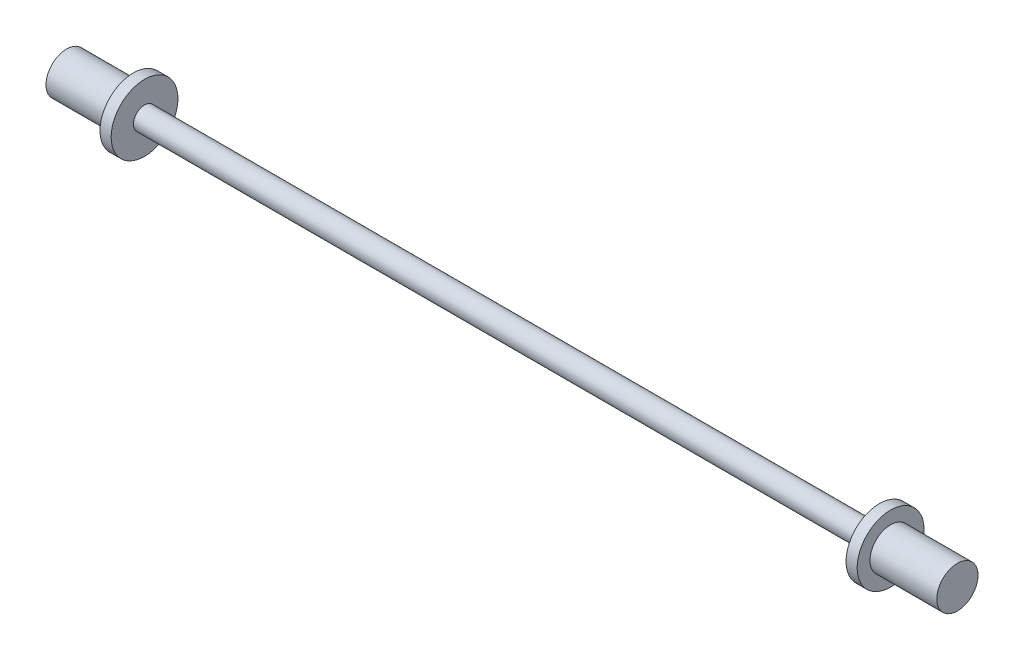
ISO-10303-21;
HEADER;
FILE_DESCRIPTION(('STEP AP214'),'2;1');
FILE_NAME('part.step','',(''),(''),'','','');
FILE_SCHEMA(('AUTOMOTIVE_DESIGN { 1 0 10303 214 1 1 1 1 }'));
ENDSEC;
DATA;
#1=APPLICATION_CONTEXT('core data for automotive mechanical design processes');
#2=APPLICATION_PROTOCOL_DEFINITION('international standard','automotive_design',2000,#1);
#3=PRODUCT_CONTEXT('',#1,'mechanical');
#4=PRODUCT('Part','Part','',(#3));
#5=PRODUCT_RELATED_PRODUCT_CATEGORY('part','',(#4));
#6=PRODUCT_DEFINITION_FORMATION('','',#4);
#7=PRODUCT_DEFINITION_CONTEXT('part definition',#1,'design');
#8=PRODUCT_DEFINITION('design','',#6,#7);
#9=PRODUCT_DEFINITION_SHAPE('','',#8);
#10=(LENGTH_UNIT() NAMED_UNIT(*) SI_UNIT(.MILLI.,.METRE.));
#11=(NAMED_UNIT(*) PLANE_ANGLE_UNIT() SI_UNIT($,.RADIAN.));
#12=(NAMED_UNIT(*) SI_UNIT($,.STERADIAN.) SOLID_ANGLE_UNIT());
#13=UNCERTAINTY_MEASURE_WITH_UNIT(LENGTH_MEASURE(1.E-05),#10,'distance_accuracy_value','');
#14=(GEOMETRIC_REPRESENTATION_CONTEXT(3) GLOBAL_UNCERTAINTY_ASSIGNED_CONTEXT((#13)) GLOBAL_UNIT_ASSIGNED_CONTEXT((#10,
#11,#12)) REPRESENTATION_CONTEXT('',''));
#15=CARTESIAN_POINT('',(0.,0.,0.));
#16=DIRECTION('',(0.,0.,1.));
#17=DIRECTION('',(1.,0.,0.));
#18=AXIS2_PLACEMENT_3D('',#15,#16,#17);
#19=CARTESIAN_POINT('',(-171.45,0.,0.));
#20=DIRECTION('',(1.,0.,0.));
#21=DIRECTION('',(0.,0.,-1.));
#22=AXIS2_PLACEMENT_3D('',#19,#20,#21);
#23=CYLINDRICAL_SURFACE('',#22,6.35);
#24=CARTESIAN_POINT('',(-171.45,0.,0.));
#25=DIRECTION('',(1.,0.,0.));
#26=DIRECTION('',(0.,0.,-1.));
#27=AXIS2_PLACEMENT_3D('',#24,#25,#26);
#28=CIRCLE('',#27,6.35);
#29=CARTESIAN_POINT('',(-171.45,0.,-6.35));
#30=VERTEX_POINT('',#29);
#31=EDGE_CURVE('E42',#30,#30,#28,.T.);
#32=ORIENTED_EDGE('',*,*,#31,.T.);
#33=EDGE_LOOP('',(#32));
#34=FACE_BOUND('',#33,.T.);
#35=CARTESIAN_POINT('',(247.65,0.,0.));
#36=DIRECTION('',(1.,0.,0.));
#37=DIRECTION('',(0.,0.,-1.));
#38=AXIS2_PLACEMENT_3D('',#35,#36,#37);
#39=CIRCLE('',#38,6.35);
#40=CARTESIAN_POINT('',(247.65,0.,-6.35));
#41=VERTEX_POINT('',#40);
#42=EDGE_CURVE('E51',#41,#41,#39,.T.);
#43=ORIENTED_EDGE('',*,*,#42,.F.);
#44=EDGE_LOOP('',(#43));
#45=FACE_BOUND('',#44,.T.);
#46=ADVANCED_FACE('F39',(#34,#45),#23,.T.);
#47=CARTESIAN_POINT('',(254.,0.,0.));
#48=DIRECTION('',(-1.,0.,0.));
#49=DIRECTION('',(0.,0.,1.));
#50=AXIS2_PLACEMENT_3D('',#47,#48,#49);
#51=CYLINDRICAL_SURFACE('',#50,19.05);
#52=CARTESIAN_POINT('',(254.,0.,0.));
#53=DIRECTION('',(1.,0.,0.));
#54=DIRECTION('',(0.,0.,-1.));
#55=AXIS2_PLACEMENT_3D('',#52,#53,#54);
#56=CIRCLE('',#55,19.05);
#57=CARTESIAN_POINT('',(254.,0.,-19.05));
#58=VERTEX_POINT('',#57);
#59=EDGE_CURVE('E65',#58,#58,#56,.T.);
#60=ORIENTED_EDGE('',*,*,#59,.F.);
#61=EDGE_LOOP('',(#60));
#62=FACE_BOUND('',#61,.T.);
#63=CARTESIAN_POINT('',(247.65,0.,0.));
#64=DIRECTION('',(1.,0.,0.));
#65=DIRECTION('',(0.,0.,-1.));
#66=AXIS2_PLACEMENT_3D('',#63,#64,#65);
#67=CIRCLE('',#66,19.05);
#68=CARTESIAN_POINT('',(247.65,0.,-19.05));
#69=VERTEX_POINT('',#68);
#70=EDGE_CURVE('E68',#69,#69,#67,.T.);
#71=ORIENTED_EDGE('',*,*,#70,.T.);
#72=EDGE_LOOP('',(#71));
#73=FACE_BOUND('',#72,.T.);
#74=ADVANCED_FACE('F77',(#62,#73),#51,.T.);
#75=CARTESIAN_POINT('',(254.,0.,0.));
#76=DIRECTION('',(1.,0.,0.));
#77=DIRECTION('',(0.,0.,-1.));
#78=AXIS2_PLACEMENT_3D('',#75,#76,#77);
#79=PLANE('',#78);
#80=CARTESIAN_POINT('',(254.,0.,0.));
#81=DIRECTION('',(1.,0.,0.));
#82=DIRECTION('',(0.,0.,-1.));
#83=AXIS2_PLACEMENT_3D('',#80,#81,#82);
#84=CIRCLE('',#83,11.77);
#85=CARTESIAN_POINT('',(254.,0.,11.77));
#86=VERTEX_POINT('',#85);
#87=EDGE_CURVE('E10',#86,#86,#84,.T.);
#88=ORIENTED_EDGE('',*,*,#87,.F.);
#89=EDGE_LOOP('',(#88));
#90=FACE_BOUND('',#89,.T.);
#91=ORIENTED_EDGE('',*,*,#59,.T.);
#92=EDGE_LOOP('',(#91));
#93=FACE_BOUND('',#92,.T.);
#94=ADVANCED_FACE('F82',(#90,#93),#79,.T.);
#95=CARTESIAN_POINT('',(247.65,0.,0.));
#96=DIRECTION('',(1.,0.,0.));
#97=DIRECTION('',(0.,0.,-1.));
#98=AXIS2_PLACEMENT_3D('',#95,#96,#97);
#99=PLANE('',#98);
#100=ORIENTED_EDGE('',*,*,#42,.T.);
#101=EDGE_LOOP('',(#100));
#102=FACE_BOUND('',#101,.T.);
#103=ORIENTED_EDGE('',*,*,#70,.F.);
#104=EDGE_LOOP('',(#103));
#105=FACE_BOUND('',#104,.T.);
#106=ADVANCED_FACE('F73',(#102,#105),#99,.F.);
#107=CARTESIAN_POINT('',(-177.8,0.,0.));
#108=DIRECTION('',(1.,0.,0.));
#109=DIRECTION('',(0.,0.,-1.));
#110=AXIS2_PLACEMENT_3D('',#107,#108,#109);
#111=CYLINDRICAL_SURFACE('',#110,19.05);
#112=CARTESIAN_POINT('',(-177.8,0.,0.));
#113=DIRECTION('',(-1.,0.,0.));
#114=DIRECTION('',(0.,0.,1.));
#115=AXIS2_PLACEMENT_3D('',#112,#113,#114);
#116=CIRCLE('',#115,19.05);
#117=CARTESIAN_POINT('',(-177.8,0.,19.05));
#118=VERTEX_POINT('',#117);
#119=EDGE_CURVE('E60',#118,#118,#116,.T.);
#120=ORIENTED_EDGE('',*,*,#119,.F.);
#121=EDGE_LOOP('',(#120));
#122=FACE_BOUND('',#121,.T.);
#123=CARTESIAN_POINT('',(-171.45,0.,0.));
#124=DIRECTION('',(-1.,0.,0.));
#125=DIRECTION('',(0.,0.,1.));
#126=AXIS2_PLACEMENT_3D('',#123,#124,#125);
#127=CIRCLE('',#126,19.05);
#128=CARTESIAN_POINT('',(-171.45,0.,19.05));
#129=VERTEX_POINT('',#128);
#130=EDGE_CURVE('E58',#129,#129,#127,.T.);
#131=ORIENTED_EDGE('',*,*,#130,.T.);
#132=EDGE_LOOP('',(#131));
#133=FACE_BOUND('',#132,.T.);
#134=ADVANCED_FACE('F95',(#122,#133),#111,.T.);
#135=CARTESIAN_POINT('',(-177.8,0.,0.));
#136=DIRECTION('',(-1.,0.,0.));
#137=DIRECTION('',(0.,0.,1.));
#138=AXIS2_PLACEMENT_3D('',#135,#136,#137);
#139=PLANE('',#138);
#140=CARTESIAN_POINT('',(-177.8,0.,0.));
#141=DIRECTION('',(-1.,0.,0.));
#142=DIRECTION('',(0.,0.,1.));
#143=AXIS2_PLACEMENT_3D('',#140,#141,#142);
#144=CIRCLE('',#143,11.77);
#145=CARTESIAN_POINT('',(-177.8,0.,-11.77));
#146=VERTEX_POINT('',#145);
#147=EDGE_CURVE('E46',#146,#146,#144,.T.);
#148=ORIENTED_EDGE('',*,*,#147,.F.);
#149=EDGE_LOOP('',(#148));
#150=FACE_BOUND('',#149,.T.);
#151=ORIENTED_EDGE('',*,*,#119,.T.);
#152=EDGE_LOOP('',(#151));
#153=FACE_BOUND('',#152,.T.);
#154=ADVANCED_FACE('F91',(#150,#153),#139,.T.);
#155=CARTESIAN_POINT('',(-171.45,0.,0.));
#156=DIRECTION('',(-1.,0.,0.));
#157=DIRECTION('',(0.,0.,1.));
#158=AXIS2_PLACEMENT_3D('',#155,#156,#157);
#159=PLANE('',#158);
#160=ORIENTED_EDGE('',*,*,#31,.F.);
#161=EDGE_LOOP('',(#160));
#162=FACE_BOUND('',#161,.T.);
#163=ORIENTED_EDGE('',*,*,#130,.F.);
#164=EDGE_LOOP('',(#163));
#165=FACE_BOUND('',#164,.T.);
#166=ADVANCED_FACE('F87',(#162,#165),#159,.F.);
#167=CARTESIAN_POINT('',(-215.9,0.,0.));
#168=DIRECTION('',(1.,0.,0.));
#169=DIRECTION('',(0.,0.,-1.));
#170=AXIS2_PLACEMENT_3D('',#167,#168,#169);
#171=CYLINDRICAL_SURFACE('',#170,11.77);
#172=CARTESIAN_POINT('',(-215.9,0.,0.));
#173=DIRECTION('',(-1.,0.,0.));
#174=DIRECTION('',(0.,0.,1.));
#175=AXIS2_PLACEMENT_3D('',#172,#173,#174);
#176=CIRCLE('',#175,11.77);
#177=CARTESIAN_POINT('',(-215.9,0.,-11.77));
#178=VERTEX_POINT('',#177);
#179=EDGE_CURVE('E56',#178,#178,#176,.T.);
#180=CARTESIAN_POINT('',(-215.9,0.,-11.77));
#181=CARTESIAN_POINT('',(-215.503125,0.,-11.77));
#182=CARTESIAN_POINT('',(-215.10625,0.,-11.77));
#183=CARTESIAN_POINT('',(-214.3125,0.,-11.77));
#184=CARTESIAN_POINT('',(-213.915625,0.,-11.77));
#185=CARTESIAN_POINT('',(-213.121875,0.,-11.77));
#186=CARTESIAN_POINT('',(-212.725,0.,-11.77));
#187=CARTESIAN_POINT('',(-211.93125,0.,-11.77));
#188=CARTESIAN_POINT('',(-211.534375,0.,-11.77));
#189=CARTESIAN_POINT('',(-210.740625,0.,-11.77));
#190=CARTESIAN_POINT('',(-210.34375,0.,-11.77));
#191=CARTESIAN_POINT('',(-209.55,0.,-11.77));
#192=CARTESIAN_POINT('',(-209.153125,0.,-11.77));
#193=CARTESIAN_POINT('',(-208.359375,0.,-11.77));
#194=CARTESIAN_POINT('',(-207.9625,0.,-11.77));
#195=CARTESIAN_POINT('',(-207.16875,0.,-11.77));
#196=CARTESIAN_POINT('',(-206.771875,0.,-11.77));
#197=CARTESIAN_POINT('',(-205.978125,0.,-11.77));
#198=CARTESIAN_POINT('',(-205.58125,0.,-11.77));
#199=CARTESIAN_POINT('',(-204.7875,0.,-11.77));
#200=CARTESIAN_POINT('',(-204.390625,0.,-11.77));
#201=CARTESIAN_POINT('',(-203.596875,0.,-11.77));
#202=CARTESIAN_POINT('',(-203.2,0.,-11.77));
#203=CARTESIAN_POINT('',(-202.40625,0.,-11.77));
#204=CARTESIAN_POINT('',(-202.009375,0.,-11.77));
#205=CARTESIAN_POINT('',(-201.215625,0.,-11.77));
#206=CARTESIAN_POINT('',(-200.81875,0.,-11.77));
#207=CARTESIAN_POINT('',(-200.025,0.,-11.77));
#208=CARTESIAN_POINT('',(-199.628125,0.,-11.77));
#209=CARTESIAN_POINT('',(-198.834375,0.,-11.77));
#210=CARTESIAN_POINT('',(-198.4375,0.,-11.77));
#211=CARTESIAN_POINT('',(-197.64375,0.,-11.77));
#212=CARTESIAN_POINT('',(-197.246875,0.,-11.77));
#213=CARTESIAN_POINT('',(-196.453125,0.,-11.77));
#214=CARTESIAN_POINT('',(-196.05625,0.,-11.77));
#215=CARTESIAN_POINT('',(-195.2625,0.,-11.77));
#216=CARTESIAN_POINT('',(-194.865625,0.,-11.77));
#217=CARTESIAN_POINT('',(-194.071875,0.,-11.77));
#218=CARTESIAN_POINT('',(-193.675,0.,-11.77));
#219=CARTESIAN_POINT('',(-192.88125,0.,-11.77));
#220=CARTESIAN_POINT('',(-192.484375,0.,-11.77));
#221=CARTESIAN_POINT('',(-191.690625,0.,-11.77));
#222=CARTESIAN_POINT('',(-191.29375,0.,-11.77));
#223=CARTESIAN_POINT('',(-190.5,0.,-11.77));
#224=CARTESIAN_POINT('',(-190.103125,0.,-11.77));
#225=CARTESIAN_POINT('',(-189.309375,0.,-11.77));
#226=CARTESIAN_POINT('',(-188.9125,0.,-11.77));
#227=CARTESIAN_POINT('',(-188.11875,0.,-11.77));
#228=CARTESIAN_POINT('',(-187.721875,0.,-11.77));
#229=CARTESIAN_POINT('',(-186.928125,0.,-11.77));
#230=CARTESIAN_POINT('',(-186.53125,0.,-11.77));
#231=CARTESIAN_POINT('',(-185.7375,0.,-11.77));
#232=CARTESIAN_POINT('',(-185.340625,0.,-11.77));
#233=CARTESIAN_POINT('',(-184.546875,0.,-11.77));
#234=CARTESIAN_POINT('',(-184.15,0.,-11.77));
#235=CARTESIAN_POINT('',(-183.35625,0.,-11.77));
#236=CARTESIAN_POINT('',(-182.959375,0.,-11.77));
#237=CARTESIAN_POINT('',(-182.165625,0.,-11.77));
#238=CARTESIAN_POINT('',(-181.76875,0.,-11.77));
#239=CARTESIAN_POINT('',(-180.975,0.,-11.77));
#240=CARTESIAN_POINT('',(-180.578125,0.,-11.77));
#241=CARTESIAN_POINT('',(-179.784375,0.,-11.77));
#242=CARTESIAN_POINT('',(-179.3875,0.,-11.77));
#243=CARTESIAN_POINT('',(-178.59375,0.,-11.77));
#244=CARTESIAN_POINT('',(-178.196875,0.,-11.77));
#245=CARTESIAN_POINT('',(-177.8,0.,-11.77));
#246=B_SPLINE_CURVE_WITH_KNOTS('',3,(#180,#181,#182,#183,#184,#185,#186,#187,#188,#189,#190,
#191,#192,#193,#194,#195,#196,#197,#198,#199,#200,#201,#202,#203,#204,#205,#206,#207,#208,#209,
#210,#211,#212,#213,#214,#215,#216,#217,#218,#219,#220,#221,#222,#223,#224,#225,#226,#227,#228,
#229,#230,#231,#232,#233,#234,#235,#236,#237,#238,#239,#240,#241,#242,#243,#244,#245),
.UNSPECIFIED.,.F.,.F.,(4,2,2,2,2,2,2,2,2,2,2,2,2,2,2,2,2,2,2,2,2,2,2,2,2,2,2,2,2,2,2,2,4),(0.,
1.19062499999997,2.38124999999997,3.57187499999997,4.76249999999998,5.95312499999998,
7.14374999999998,8.33437499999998,9.52499999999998,10.715625,11.90625,13.096875,14.2875,
15.478125,16.66875,17.859375,19.05,20.240625,21.43125,22.621875,23.8125,25.003125,26.19375,
27.384375,28.575,29.765625,30.95625,32.146875,33.3375,34.528125,35.71875,36.909375,38.1),.UNSPECIFIED.);
#247=EDGE_CURVE('BSEAM90',#178,#146,#246,.T.);
#248=ORIENTED_EDGE('',*,*,#179,.F.);
#249=ORIENTED_EDGE('',*,*,#147,.T.);
#250=ORIENTED_EDGE('',*,*,#247,.T.);
#251=ORIENTED_EDGE('',*,*,#247,.F.);
#252=EDGE_LOOP('',(#248,#250,#249,#251));
#253=FACE_BOUND('',#252,.T.);
#254=ADVANCED_FACE('F90',(#253),#171,.T.);
#255=CARTESIAN_POINT('',(-215.9,0.,0.));
#256=DIRECTION('',(-1.,0.,0.));
#257=DIRECTION('',(0.,0.,1.));
#258=AXIS2_PLACEMENT_3D('',#255,#256,#257);
#259=PLANE('',#258);
#260=ORIENTED_EDGE('',*,*,#179,.T.);
#261=EDGE_LOOP('',(#260));
#262=FACE_BOUND('',#261,.T.);
#263=ADVANCED_FACE('F123',(#262),#259,.T.);
#264=CARTESIAN_POINT('',(292.1,0.,0.));
#265=DIRECTION('',(-1.,0.,0.));
#266=DIRECTION('',(0.,0.,1.));
#267=AXIS2_PLACEMENT_3D('',#264,#265,#266);
#268=CYLINDRICAL_SURFACE('',#267,11.77);
#269=CARTESIAN_POINT('',(292.1,0.,0.));
#270=DIRECTION('',(1.,0.,0.));
#271=DIRECTION('',(0.,0.,-1.));
#272=AXIS2_PLACEMENT_3D('',#269,#270,#271);
#273=CIRCLE('',#272,11.77);
#274=CARTESIAN_POINT('',(292.1,0.,11.77));
#275=VERTEX_POINT('',#274);
#276=EDGE_CURVE('E55',#275,#275,#273,.T.);
#277=CARTESIAN_POINT('',(292.1,0.,11.77));
#278=CARTESIAN_POINT('',(291.703125,0.,11.77));
#279=CARTESIAN_POINT('',(291.30625,0.,11.77));
#280=CARTESIAN_POINT('',(290.5125,0.,11.77));
#281=CARTESIAN_POINT('',(290.115625,0.,11.77));
#282=CARTESIAN_POINT('',(289.321875,0.,11.77));
#283=CARTESIAN_POINT('',(288.925,0.,11.77));
#284=CARTESIAN_POINT('',(288.13125,0.,11.77));
#285=CARTESIAN_POINT('',(287.734375,0.,11.77));
#286=CARTESIAN_POINT('',(286.940625,0.,11.77));
#287=CARTESIAN_POINT('',(286.54375,0.,11.77));
#288=CARTESIAN_POINT('',(285.75,0.,11.77));
#289=CARTESIAN_POINT('',(285.353125,0.,11.77));
#290=CARTESIAN_POINT('',(284.559375,0.,11.77));
#291=CARTESIAN_POINT('',(284.1625,0.,11.77));
#292=CARTESIAN_POINT('',(283.36875,0.,11.77));
#293=CARTESIAN_POINT('',(282.971875,0.,11.77));
#294=CARTESIAN_POINT('',(282.178125,0.,11.77));
#295=CARTESIAN_POINT('',(281.78125,0.,11.77));
#296=CARTESIAN_POINT('',(280.9875,0.,11.77));
#297=CARTESIAN_POINT('',(280.590625,0.,11.77));
#298=CARTESIAN_POINT('',(279.796875,0.,11.77));
#299=CARTESIAN_POINT('',(279.4,0.,11.77));
#300=CARTESIAN_POINT('',(278.60625,0.,11.77));
#301=CARTESIAN_POINT('',(278.209375,0.,11.77));
#302=CARTESIAN_POINT('',(277.415625,0.,11.77));
#303=CARTESIAN_POINT('',(277.01875,0.,11.77));
#304=CARTESIAN_POINT('',(276.225,0.,11.77));
#305=CARTESIAN_POINT('',(275.828125,0.,11.77));
#306=CARTESIAN_POINT('',(275.034375,0.,11.77));
#307=CARTESIAN_POINT('',(274.6375,0.,11.77));
#308=CARTESIAN_POINT('',(273.84375,0.,11.77));
#309=CARTESIAN_POINT('',(273.446875,0.,11.77));
#310=CARTESIAN_POINT('',(272.653125,0.,11.77));
#311=CARTESIAN_POINT('',(272.25625,0.,11.77));
#312=CARTESIAN_POINT('',(271.4625,0.,11.77));
#313=CARTESIAN_POINT('',(271.065625,0.,11.77));
#314=CARTESIAN_POINT('',(270.271875,0.,11.77));
#315=CARTESIAN_POINT('',(269.875,0.,11.77));
#316=CARTESIAN_POINT('',(269.08125,0.,11.77));
#317=CARTESIAN_POINT('',(268.684375,0.,11.77));
#318=CARTESIAN_POINT('',(267.890625,0.,11.77));
#319=CARTESIAN_POINT('',(267.49375,0.,11.77));
#320=CARTESIAN_POINT('',(266.7,0.,11.77));
#321=CARTESIAN_POINT('',(266.303125,0.,11.77));
#322=CARTESIAN_POINT('',(265.509375,0.,11.77));
#323=CARTESIAN_POINT('',(265.1125,0.,11.77));
#324=CARTESIAN_POINT('',(264.31875,0.,11.77));
#325=CARTESIAN_POINT('',(263.921875,0.,11.77));
#326=CARTESIAN_POINT('',(263.128125,0.,11.77));
#327=CARTESIAN_POINT('',(262.73125,0.,11.77));
#328=CARTESIAN_POINT('',(261.9375,0.,11.77));
#329=CARTESIAN_POINT('',(261.540625,0.,11.77));
#330=CARTESIAN_POINT('',(260.746875,0.,11.77));
#331=CARTESIAN_POINT('',(260.35,0.,11.77));
#332=CARTESIAN_POINT('',(259.55625,0.,11.77));
#333=CARTESIAN_POINT('',(259.159375,0.,11.77));
#334=CARTESIAN_POINT('',(258.365625,0.,11.77));
#335=CARTESIAN_POINT('',(257.96875,0.,11.77));
#336=CARTESIAN_POINT('',(257.175,0.,11.77));
#337=CARTESIAN_POINT('',(256.778125,0.,11.77));
#338=CARTESIAN_POINT('',(255.984375,0.,11.77));
#339=CARTESIAN_POINT('',(255.5875,0.,11.77));
#340=CARTESIAN_POINT('',(254.79375,0.,11.77));
#341=CARTESIAN_POINT('',(254.396875,0.,11.77));
#342=CARTESIAN_POINT('',(254.,0.,11.77));
#343=B_SPLINE_CURVE_WITH_KNOTS('',3,(#277,#278,#279,#280,#281,#282,#283,#284,#285,#286,#287,
#288,#289,#290,#291,#292,#293,#294,#295,#296,#297,#298,#299,#300,#301,#302,#303,#304,#305,#306,
#307,#308,#309,#310,#311,#312,#313,#314,#315,#316,#317,#318,#319,#320,#321,#322,#323,#324,#325,
#326,#327,#328,#329,#330,#331,#332,#333,#334,#335,#336,#337,#338,#339,#340,#341,#342),
.UNSPECIFIED.,.F.,.F.,(4,2,2,2,2,2,2,2,2,2,2,2,2,2,2,2,2,2,2,2,2,2,2,2,2,2,2,2,2,2,2,2,4),(0.,
1.190625,2.38125,3.571875,4.7625,5.953125,7.14375,8.334375,9.52500000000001,10.715625,11.90625,
13.096875,14.2875,15.478125,16.66875,17.859375,19.05,20.240625,21.43125,22.621875,23.8125,
25.003125,26.19375,27.384375,28.575,29.765625,30.95625,32.146875,33.3375,34.528125,35.71875,
36.909375,38.1),.UNSPECIFIED.);
#344=EDGE_CURVE('BSEAM127',#275,#86,#343,.T.);
#345=ORIENTED_EDGE('',*,*,#276,.F.);
#346=ORIENTED_EDGE('',*,*,#87,.T.);
#347=ORIENTED_EDGE('',*,*,#344,.T.);
#348=ORIENTED_EDGE('',*,*,#344,.F.);
#349=EDGE_LOOP('',(#345,#347,#346,#348));
#350=FACE_BOUND('',#349,.T.);
#351=ADVANCED_FACE('F127',(#350),#268,.T.);
#352=CARTESIAN_POINT('',(292.1,0.,0.));
#353=DIRECTION('',(1.,0.,0.));
#354=DIRECTION('',(0.,0.,-1.));
#355=AXIS2_PLACEMENT_3D('',#352,#353,#354);
#356=PLANE('',#355);
#357=ORIENTED_EDGE('',*,*,#276,.T.);
#358=EDGE_LOOP('',(#357));
#359=FACE_BOUND('',#358,.T.);
#360=ADVANCED_FACE('F131',(#359),#356,.T.);
#361=CLOSED_SHELL('',(#46,#74,#94,#106,#134,#154,#166,#254,#263,#351,#360));
#362=MANIFOLD_SOLID_BREP('B2',#361);
#363=ADVANCED_BREP_SHAPE_REPRESENTATION('',(#18,#362),#14);
#364=SHAPE_DEFINITION_REPRESENTATION(#9,#363);
ENDSEC;
END-ISO-10303-21;
